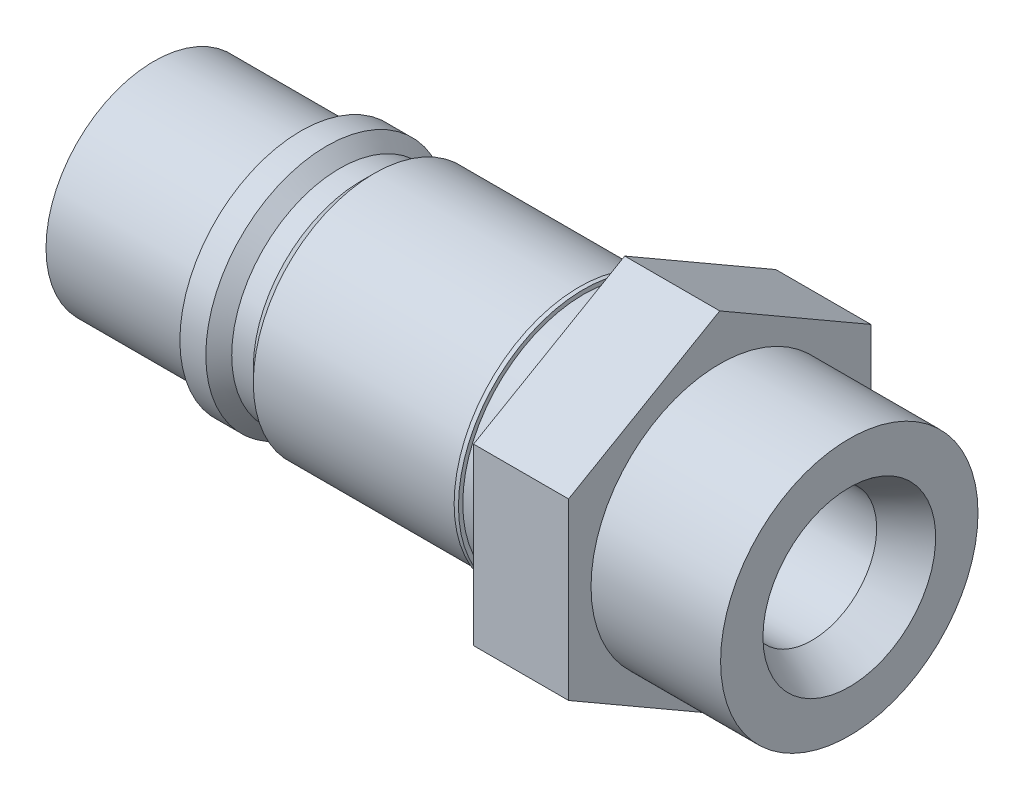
ISO-10303-21;
HEADER;
FILE_DESCRIPTION(('STEP AP214'),'2;1');
FILE_NAME('part.step','',(''),(''),'','','');
FILE_SCHEMA(('AUTOMOTIVE_DESIGN { 1 0 10303 214 1 1 1 1 }'));
ENDSEC;
DATA;
#1=APPLICATION_CONTEXT('core data for automotive mechanical design processes');
#2=APPLICATION_PROTOCOL_DEFINITION('international standard','automotive_design',2000,#1);
#3=PRODUCT_CONTEXT('',#1,'mechanical');
#4=PRODUCT('Part','Part','',(#3));
#5=PRODUCT_RELATED_PRODUCT_CATEGORY('part','',(#4));
#6=PRODUCT_DEFINITION_FORMATION('','',#4);
#7=PRODUCT_DEFINITION_CONTEXT('part definition',#1,'design');
#8=PRODUCT_DEFINITION('design','',#6,#7);
#9=PRODUCT_DEFINITION_SHAPE('','',#8);
#10=(LENGTH_UNIT() NAMED_UNIT(*) SI_UNIT(.MILLI.,.METRE.));
#11=(NAMED_UNIT(*) PLANE_ANGLE_UNIT() SI_UNIT($,.RADIAN.));
#12=(NAMED_UNIT(*) SI_UNIT($,.STERADIAN.) SOLID_ANGLE_UNIT());
#13=UNCERTAINTY_MEASURE_WITH_UNIT(LENGTH_MEASURE(1.E-05),#10,'distance_accuracy_value','');
#14=(GEOMETRIC_REPRESENTATION_CONTEXT(3) GLOBAL_UNCERTAINTY_ASSIGNED_CONTEXT((#13)) GLOBAL_UNIT_ASSIGNED_CONTEXT((#10,
#11,#12)) REPRESENTATION_CONTEXT('',''));
#15=CARTESIAN_POINT('',(0.,0.,0.));
#16=DIRECTION('',(0.,0.,1.));
#17=DIRECTION('',(1.,0.,0.));
#18=AXIS2_PLACEMENT_3D('',#15,#16,#17);
#19=CARTESIAN_POINT('',(0.,0.,0.));
#20=DIRECTION('',(1.,0.,0.));
#21=DIRECTION('',(0.,0.,-1.));
#22=AXIS2_PLACEMENT_3D('',#19,#20,#21);
#23=PLANE('',#22);
#24=CARTESIAN_POINT('',(0.,0.,0.));
#25=DIRECTION('',(-1.,0.,0.));
#26=DIRECTION('',(0.,0.,1.));
#27=AXIS2_PLACEMENT_3D('',#24,#25,#26);
#28=CIRCLE('',#27,15.);
#29=CARTESIAN_POINT('',(0.,0.,15.));
#30=VERTEX_POINT('',#29);
#31=EDGE_CURVE('E273',#30,#30,#28,.T.);
#32=ORIENTED_EDGE('',*,*,#31,.F.);
#33=EDGE_LOOP('',(#32));
#34=FACE_BOUND('',#33,.T.);
#35=CARTESIAN_POINT('',(0.,0.,0.));
#36=DIRECTION('',(-1.,0.,0.));
#37=DIRECTION('',(0.,0.,1.));
#38=AXIS2_PLACEMENT_3D('',#35,#36,#37);
#39=CIRCLE('',#38,25.);
#40=CARTESIAN_POINT('',(0.,0.,25.));
#41=VERTEX_POINT('',#40);
#42=EDGE_CURVE('E36',#41,#41,#39,.T.);
#43=ORIENTED_EDGE('',*,*,#42,.T.);
#44=EDGE_LOOP('',(#43));
#45=FACE_BOUND('',#44,.T.);
#46=ADVANCED_FACE('F33',(#34,#45),#23,.F.);
#47=CARTESIAN_POINT('',(0.,0.,0.));
#48=DIRECTION('',(-1.,0.,0.));
#49=DIRECTION('',(0.,0.,1.));
#50=AXIS2_PLACEMENT_3D('',#47,#48,#49);
#51=CYLINDRICAL_SURFACE('',#50,25.);
#52=ORIENTED_EDGE('',*,*,#42,.F.);
#53=EDGE_LOOP('',(#52));
#54=FACE_BOUND('',#53,.T.);
#55=CARTESIAN_POINT('',(34.,0.,0.));
#56=DIRECTION('',(-1.,0.,0.));
#57=DIRECTION('',(0.,0.,1.));
#58=AXIS2_PLACEMENT_3D('',#55,#56,#57);
#59=CIRCLE('',#58,25.);
#60=CARTESIAN_POINT('',(34.,0.,25.));
#61=VERTEX_POINT('',#60);
#62=EDGE_CURVE('E168',#61,#61,#59,.T.);
#63=ORIENTED_EDGE('',*,*,#62,.T.);
#64=EDGE_LOOP('',(#63));
#65=FACE_BOUND('',#64,.T.);
#66=ADVANCED_FACE('F176',(#54,#65),#51,.T.);
#67=CARTESIAN_POINT('',(34.,25.,0.));
#68=DIRECTION('',(1.,0.,0.));
#69=DIRECTION('',(0.,0.,-1.));
#70=AXIS2_PLACEMENT_3D('',#67,#68,#69);
#71=PLANE('',#70);
#72=ORIENTED_EDGE('',*,*,#62,.F.);
#73=EDGE_LOOP('',(#72));
#74=FACE_BOUND('',#73,.T.);
#75=CARTESIAN_POINT('',(34.,0.,0.));
#76=DIRECTION('',(-1.,0.,0.));
#77=DIRECTION('',(0.,0.,1.));
#78=AXIS2_PLACEMENT_3D('',#75,#76,#77);
#79=CIRCLE('',#78,28.);
#80=CARTESIAN_POINT('',(34.,0.,28.));
#81=VERTEX_POINT('',#80);
#82=EDGE_CURVE('E166',#81,#81,#79,.T.);
#83=ORIENTED_EDGE('',*,*,#82,.T.);
#84=EDGE_LOOP('',(#83));
#85=FACE_BOUND('',#84,.T.);
#86=ADVANCED_FACE('F178',(#74,#85),#71,.F.);
#87=CARTESIAN_POINT('',(0.,0.,0.));
#88=DIRECTION('',(-1.,0.,0.));
#89=DIRECTION('',(0.,0.,1.));
#90=AXIS2_PLACEMENT_3D('',#87,#88,#89);
#91=CYLINDRICAL_SURFACE('',#90,28.);
#92=ORIENTED_EDGE('',*,*,#82,.F.);
#93=EDGE_LOOP('',(#92));
#94=FACE_BOUND('',#93,.T.);
#95=CARTESIAN_POINT('',(40.,0.,0.));
#96=DIRECTION('',(-1.,0.,0.));
#97=DIRECTION('',(0.,0.,1.));
#98=AXIS2_PLACEMENT_3D('',#95,#96,#97);
#99=CIRCLE('',#98,28.);
#100=CARTESIAN_POINT('',(40.,0.,28.));
#101=VERTEX_POINT('',#100);
#102=EDGE_CURVE('E163',#101,#101,#99,.T.);
#103=ORIENTED_EDGE('',*,*,#102,.T.);
#104=EDGE_LOOP('',(#103));
#105=FACE_BOUND('',#104,.T.);
#106=ADVANCED_FACE('F183',(#94,#105),#91,.T.);
#107=CARTESIAN_POINT('',(43.,0.,0.));
#108=DIRECTION('',(-1.,0.,0.));
#109=DIRECTION('',(0.,0.,1.));
#110=AXIS2_PLACEMENT_3D('',#107,#108,#109);
#111=CONICAL_SURFACE('',#110,25.,0.78539816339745);
#112=ORIENTED_EDGE('',*,*,#102,.F.);
#113=EDGE_LOOP('',(#112));
#114=FACE_BOUND('',#113,.T.);
#115=CARTESIAN_POINT('',(43.,0.,0.));
#116=DIRECTION('',(-1.,0.,0.));
#117=DIRECTION('',(0.,0.,1.));
#118=AXIS2_PLACEMENT_3D('',#115,#116,#117);
#119=CIRCLE('',#118,25.);
#120=CARTESIAN_POINT('',(43.,0.,25.));
#121=VERTEX_POINT('',#120);
#122=EDGE_CURVE('E160',#121,#121,#119,.T.);
#123=ORIENTED_EDGE('',*,*,#122,.T.);
#124=EDGE_LOOP('',(#123));
#125=FACE_BOUND('',#124,.T.);
#126=ADVANCED_FACE('F190',(#114,#125),#111,.T.);
#127=CARTESIAN_POINT('',(0.,0.,0.));
#128=DIRECTION('',(-1.,0.,0.));
#129=DIRECTION('',(0.,0.,1.));
#130=AXIS2_PLACEMENT_3D('',#127,#128,#129);
#131=CYLINDRICAL_SURFACE('',#130,25.);
#132=ORIENTED_EDGE('',*,*,#122,.F.);
#133=EDGE_LOOP('',(#132));
#134=FACE_BOUND('',#133,.T.);
#135=CARTESIAN_POINT('',(48.,0.,0.));
#136=DIRECTION('',(-1.,0.,0.));
#137=DIRECTION('',(0.,0.,1.));
#138=AXIS2_PLACEMENT_3D('',#135,#136,#137);
#139=CIRCLE('',#138,25.);
#140=CARTESIAN_POINT('',(48.,0.,25.));
#141=VERTEX_POINT('',#140);
#142=EDGE_CURVE('E157',#141,#141,#139,.T.);
#143=ORIENTED_EDGE('',*,*,#142,.T.);
#144=EDGE_LOOP('',(#143));
#145=FACE_BOUND('',#144,.T.);
#146=ADVANCED_FACE('F194',(#134,#145),#131,.T.);
#147=CARTESIAN_POINT('',(51.,0.,0.));
#148=DIRECTION('',(1.,0.,0.));
#149=DIRECTION('',(0.,0.,-1.));
#150=AXIS2_PLACEMENT_3D('',#147,#148,#149);
#151=CONICAL_SURFACE('',#150,28.,0.785398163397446);
#152=ORIENTED_EDGE('',*,*,#142,.F.);
#153=EDGE_LOOP('',(#152));
#154=FACE_BOUND('',#153,.T.);
#155=CARTESIAN_POINT('',(51.,0.,0.));
#156=DIRECTION('',(-1.,0.,0.));
#157=DIRECTION('',(0.,0.,1.));
#158=AXIS2_PLACEMENT_3D('',#155,#156,#157);
#159=CIRCLE('',#158,28.);
#160=CARTESIAN_POINT('',(51.,0.,28.));
#161=VERTEX_POINT('',#160);
#162=EDGE_CURVE('E154',#161,#161,#159,.T.);
#163=ORIENTED_EDGE('',*,*,#162,.T.);
#164=EDGE_LOOP('',(#163));
#165=FACE_BOUND('',#164,.T.);
#166=ADVANCED_FACE('F198',(#154,#165),#151,.T.);
#167=CARTESIAN_POINT('',(0.,0.,0.));
#168=DIRECTION('',(-1.,0.,0.));
#169=DIRECTION('',(0.,0.,1.));
#170=AXIS2_PLACEMENT_3D('',#167,#168,#169);
#171=CYLINDRICAL_SURFACE('',#170,28.);
#172=ORIENTED_EDGE('',*,*,#162,.F.);
#173=EDGE_LOOP('',(#172));
#174=FACE_BOUND('',#173,.T.);
#175=CARTESIAN_POINT('',(98.5,0.,0.));
#176=DIRECTION('',(-1.,0.,0.));
#177=DIRECTION('',(0.,0.,1.));
#178=AXIS2_PLACEMENT_3D('',#175,#176,#177);
#179=CIRCLE('',#178,28.);
#180=CARTESIAN_POINT('',(98.5,0.,28.));
#181=VERTEX_POINT('',#180);
#182=EDGE_CURVE('E151',#181,#181,#179,.T.);
#183=ORIENTED_EDGE('',*,*,#182,.T.);
#184=EDGE_LOOP('',(#183));
#185=FACE_BOUND('',#184,.T.);
#186=ADVANCED_FACE('F202',(#174,#185),#171,.T.);
#187=CARTESIAN_POINT('',(98.5,28.,0.));
#188=DIRECTION('',(1.,0.,0.));
#189=DIRECTION('',(0.,0.,-1.));
#190=AXIS2_PLACEMENT_3D('',#187,#188,#189);
#191=PLANE('',#190);
#192=ORIENTED_EDGE('',*,*,#182,.F.);
#193=EDGE_LOOP('',(#192));
#194=FACE_BOUND('',#193,.T.);
#195=CARTESIAN_POINT('',(98.5,0.,0.));
#196=DIRECTION('',(-1.,0.,0.));
#197=DIRECTION('',(0.,0.,1.));
#198=AXIS2_PLACEMENT_3D('',#195,#196,#197);
#199=CIRCLE('',#198,29.);
#200=CARTESIAN_POINT('',(98.5,0.,29.));
#201=VERTEX_POINT('',#200);
#202=EDGE_CURVE('E148',#201,#201,#199,.T.);
#203=ORIENTED_EDGE('',*,*,#202,.T.);
#204=EDGE_LOOP('',(#203));
#205=FACE_BOUND('',#204,.T.);
#206=ADVANCED_FACE('F206',(#194,#205),#191,.F.);
#207=CARTESIAN_POINT('',(0.,0.,0.));
#208=DIRECTION('',(-1.,0.,0.));
#209=DIRECTION('',(0.,0.,1.));
#210=AXIS2_PLACEMENT_3D('',#207,#208,#209);
#211=CYLINDRICAL_SURFACE('',#210,29.);
#212=ORIENTED_EDGE('',*,*,#202,.F.);
#213=EDGE_LOOP('',(#212));
#214=FACE_BOUND('',#213,.T.);
#215=CARTESIAN_POINT('',(99.5,0.,0.));
#216=DIRECTION('',(-1.,0.,0.));
#217=DIRECTION('',(0.,0.,1.));
#218=AXIS2_PLACEMENT_3D('',#215,#216,#217);
#219=CIRCLE('',#218,29.);
#220=CARTESIAN_POINT('',(99.5,0.,29.));
#221=VERTEX_POINT('',#220);
#222=EDGE_CURVE('E145',#221,#221,#219,.T.);
#223=ORIENTED_EDGE('',*,*,#222,.T.);
#224=EDGE_LOOP('',(#223));
#225=FACE_BOUND('',#224,.T.);
#226=ADVANCED_FACE('F210',(#214,#225),#211,.T.);
#227=CARTESIAN_POINT('',(99.5,29.,0.));
#228=DIRECTION('',(-1.,0.,0.));
#229=DIRECTION('',(0.,0.,1.));
#230=AXIS2_PLACEMENT_3D('',#227,#228,#229);
#231=PLANE('',#230);
#232=ORIENTED_EDGE('',*,*,#222,.F.);
#233=EDGE_LOOP('',(#232));
#234=FACE_BOUND('',#233,.T.);
#235=CARTESIAN_POINT('',(99.5,0.,0.));
#236=DIRECTION('',(-1.,0.,0.));
#237=DIRECTION('',(0.,0.,1.));
#238=AXIS2_PLACEMENT_3D('',#235,#236,#237);
#239=CIRCLE('',#238,28.);
#240=CARTESIAN_POINT('',(99.5,0.,28.));
#241=VERTEX_POINT('',#240);
#242=EDGE_CURVE('E142',#241,#241,#239,.T.);
#243=ORIENTED_EDGE('',*,*,#242,.T.);
#244=EDGE_LOOP('',(#243));
#245=FACE_BOUND('',#244,.T.);
#246=ADVANCED_FACE('F214',(#234,#245),#231,.F.);
#247=CARTESIAN_POINT('',(0.,0.,0.));
#248=DIRECTION('',(-1.,0.,0.));
#249=DIRECTION('',(0.,0.,1.));
#250=AXIS2_PLACEMENT_3D('',#247,#248,#249);
#251=CYLINDRICAL_SURFACE('',#250,28.);
#252=ORIENTED_EDGE('',*,*,#242,.F.);
#253=EDGE_LOOP('',(#252));
#254=FACE_BOUND('',#253,.T.);
#255=CARTESIAN_POINT('',(109.,0.,0.));
#256=DIRECTION('',(-1.,0.,0.));
#257=DIRECTION('',(0.,0.,1.));
#258=AXIS2_PLACEMENT_3D('',#255,#256,#257);
#259=CIRCLE('',#258,28.);
#260=CARTESIAN_POINT('',(109.,0.,28.));
#261=VERTEX_POINT('',#260);
#262=EDGE_CURVE('E139',#261,#261,#259,.T.);
#263=ORIENTED_EDGE('',*,*,#262,.T.);
#264=EDGE_LOOP('',(#263));
#265=FACE_BOUND('',#264,.T.);
#266=ADVANCED_FACE('F218',(#254,#265),#251,.T.);
#267=CARTESIAN_POINT('',(131.,20.2072594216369,-35.));
#268=DIRECTION('',(0.,-0.866025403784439,0.5));
#269=DIRECTION('',(0.,-0.5,-0.866025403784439));
#270=AXIS2_PLACEMENT_3D('',#267,#268,#269);
#271=PLANE('',#270);
#272=DIRECTION('',(0.,0.5,0.866025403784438));
#273=VECTOR('',#272,1.);
#274=CARTESIAN_POINT('',(109.,20.2072594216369,-35.));
#275=LINE('',#274,#273);
#276=CARTESIAN_POINT('',(109.,20.2072594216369,-35.));
#277=VERTEX_POINT('',#276);
#278=CARTESIAN_POINT('',(109.,40.4145188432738,0.));
#279=VERTEX_POINT('',#278);
#280=EDGE_CURVE('E119',#277,#279,#275,.T.);
#281=ORIENTED_EDGE('',*,*,#280,.T.);
#282=DIRECTION('',(-1.,0.,0.));
#283=VECTOR('',#282,1.);
#284=CARTESIAN_POINT('',(131.,40.4145188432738,0.));
#285=LINE('',#284,#283);
#286=CARTESIAN_POINT('',(131.,40.4145188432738,0.));
#287=VERTEX_POINT('',#286);
#288=EDGE_CURVE('E137',#287,#279,#285,.T.);
#289=ORIENTED_EDGE('',*,*,#288,.F.);
#290=DIRECTION('',(0.,0.5,0.866025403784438));
#291=VECTOR('',#290,1.);
#292=CARTESIAN_POINT('',(131.,20.2072594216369,-35.));
#293=LINE('',#292,#291);
#294=CARTESIAN_POINT('',(131.,20.2072594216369,-35.));
#295=VERTEX_POINT('',#294);
#296=EDGE_CURVE('E130',#295,#287,#293,.T.);
#297=ORIENTED_EDGE('',*,*,#296,.F.);
#298=DIRECTION('',(-1.,0.,0.));
#299=VECTOR('',#298,1.);
#300=CARTESIAN_POINT('',(131.,20.2072594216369,-35.));
#301=LINE('',#300,#299);
#302=EDGE_CURVE('E115',#295,#277,#301,.T.);
#303=ORIENTED_EDGE('',*,*,#302,.T.);
#304=EDGE_LOOP('',(#281,#289,#297,#303));
#305=FACE_BOUND('',#304,.T.);
#306=ADVANCED_FACE('F222',(#305),#271,.F.);
#307=CARTESIAN_POINT('',(131.,40.4145188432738,0.));
#308=DIRECTION('',(0.,-0.866025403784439,-0.5));
#309=DIRECTION('',(0.,0.5,-0.866025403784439));
#310=AXIS2_PLACEMENT_3D('',#307,#308,#309);
#311=PLANE('',#310);
#312=DIRECTION('',(0.,-0.5,0.866025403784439));
#313=VECTOR('',#312,1.);
#314=CARTESIAN_POINT('',(109.,40.4145188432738,0.));
#315=LINE('',#314,#313);
#316=CARTESIAN_POINT('',(109.,20.2072594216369,35.));
#317=VERTEX_POINT('',#316);
#318=EDGE_CURVE('E122',#279,#317,#315,.T.);
#319=ORIENTED_EDGE('',*,*,#318,.T.);
#320=DIRECTION('',(-1.,0.,0.));
#321=VECTOR('',#320,1.);
#322=CARTESIAN_POINT('',(131.,20.2072594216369,35.));
#323=LINE('',#322,#321);
#324=CARTESIAN_POINT('',(131.,20.2072594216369,35.));
#325=VERTEX_POINT('',#324);
#326=EDGE_CURVE('E134',#325,#317,#323,.T.);
#327=ORIENTED_EDGE('',*,*,#326,.F.);
#328=DIRECTION('',(0.,-0.5,0.866025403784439));
#329=VECTOR('',#328,1.);
#330=CARTESIAN_POINT('',(131.,40.4145188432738,0.));
#331=LINE('',#330,#329);
#332=EDGE_CURVE('E88',#287,#325,#331,.T.);
#333=ORIENTED_EDGE('',*,*,#332,.F.);
#334=ORIENTED_EDGE('',*,*,#288,.T.);
#335=EDGE_LOOP('',(#319,#327,#333,#334));
#336=FACE_BOUND('',#335,.T.);
#337=ADVANCED_FACE('F226',(#336),#311,.F.);
#338=CARTESIAN_POINT('',(131.,20.2072594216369,35.));
#339=DIRECTION('',(0.,0.,-1.));
#340=DIRECTION('',(-1.,0.,0.));
#341=AXIS2_PLACEMENT_3D('',#338,#339,#340);
#342=PLANE('',#341);
#343=DIRECTION('',(0.,-1.,0.));
#344=VECTOR('',#343,1.);
#345=CARTESIAN_POINT('',(109.,20.2072594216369,35.));
#346=LINE('',#345,#344);
#347=CARTESIAN_POINT('',(109.,-20.2072594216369,35.));
#348=VERTEX_POINT('',#347);
#349=EDGE_CURVE('E125',#317,#348,#346,.T.);
#350=ORIENTED_EDGE('',*,*,#349,.T.);
#351=DIRECTION('',(-1.,0.,0.));
#352=VECTOR('',#351,1.);
#353=CARTESIAN_POINT('',(131.,-20.2072594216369,35.));
#354=LINE('',#353,#352);
#355=CARTESIAN_POINT('',(131.,-20.2072594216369,35.));
#356=VERTEX_POINT('',#355);
#357=EDGE_CURVE('E110',#356,#348,#354,.T.);
#358=ORIENTED_EDGE('',*,*,#357,.F.);
#359=DIRECTION('',(0.,-1.,0.));
#360=VECTOR('',#359,1.);
#361=CARTESIAN_POINT('',(131.,20.2072594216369,35.));
#362=LINE('',#361,#360);
#363=EDGE_CURVE('E101',#325,#356,#362,.T.);
#364=ORIENTED_EDGE('',*,*,#363,.F.);
#365=ORIENTED_EDGE('',*,*,#326,.T.);
#366=EDGE_LOOP('',(#350,#358,#364,#365));
#367=FACE_BOUND('',#366,.T.);
#368=ADVANCED_FACE('F230',(#367),#342,.F.);
#369=CARTESIAN_POINT('',(131.,-20.2072594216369,35.));
#370=DIRECTION('',(0.,0.866025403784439,-0.5));
#371=DIRECTION('',(0.,0.5,0.866025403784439));
#372=AXIS2_PLACEMENT_3D('',#369,#370,#371);
#373=PLANE('',#372);
#374=DIRECTION('',(0.,-0.5,-0.866025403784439));
#375=VECTOR('',#374,1.);
#376=CARTESIAN_POINT('',(109.,-20.2072594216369,35.));
#377=LINE('',#376,#375);
#378=CARTESIAN_POINT('',(109.,-40.4145188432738,0.));
#379=VERTEX_POINT('',#378);
#380=EDGE_CURVE('E109',#348,#379,#377,.T.);
#381=ORIENTED_EDGE('',*,*,#380,.T.);
#382=DIRECTION('',(-1.,0.,0.));
#383=VECTOR('',#382,1.);
#384=CARTESIAN_POINT('',(131.,-40.4145188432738,0.));
#385=LINE('',#384,#383);
#386=CARTESIAN_POINT('',(131.,-40.4145188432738,0.));
#387=VERTEX_POINT('',#386);
#388=EDGE_CURVE('E106',#387,#379,#385,.T.);
#389=ORIENTED_EDGE('',*,*,#388,.F.);
#390=DIRECTION('',(0.,-0.5,-0.866025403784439));
#391=VECTOR('',#390,1.);
#392=CARTESIAN_POINT('',(131.,-20.2072594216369,35.));
#393=LINE('',#392,#391);
#394=EDGE_CURVE('E95',#356,#387,#393,.T.);
#395=ORIENTED_EDGE('',*,*,#394,.F.);
#396=ORIENTED_EDGE('',*,*,#357,.T.);
#397=EDGE_LOOP('',(#381,#389,#395,#396));
#398=FACE_BOUND('',#397,.T.);
#399=ADVANCED_FACE('F107',(#398),#373,.F.);
#400=CARTESIAN_POINT('',(131.,-40.4145188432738,0.));
#401=DIRECTION('',(0.,0.866025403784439,0.5));
#402=DIRECTION('',(0.,-0.5,0.866025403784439));
#403=AXIS2_PLACEMENT_3D('',#400,#401,#402);
#404=PLANE('',#403);
#405=DIRECTION('',(0.,0.5,-0.866025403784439));
#406=VECTOR('',#405,1.);
#407=CARTESIAN_POINT('',(109.,-40.4145188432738,0.));
#408=LINE('',#407,#406);
#409=CARTESIAN_POINT('',(109.,-20.2072594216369,-35.));
#410=VERTEX_POINT('',#409);
#411=EDGE_CURVE('E73',#379,#410,#408,.T.);
#412=ORIENTED_EDGE('',*,*,#411,.T.);
#413=DIRECTION('',(-1.,0.,0.));
#414=VECTOR('',#413,1.);
#415=CARTESIAN_POINT('',(131.,-20.2072594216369,-35.));
#416=LINE('',#415,#414);
#417=CARTESIAN_POINT('',(131.,-20.2072594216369,-35.));
#418=VERTEX_POINT('',#417);
#419=EDGE_CURVE('E111',#418,#410,#416,.T.);
#420=ORIENTED_EDGE('',*,*,#419,.F.);
#421=DIRECTION('',(0.,0.5,-0.866025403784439));
#422=VECTOR('',#421,1.);
#423=CARTESIAN_POINT('',(131.,-40.4145188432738,0.));
#424=LINE('',#423,#422);
#425=EDGE_CURVE('E99',#387,#418,#424,.T.);
#426=ORIENTED_EDGE('',*,*,#425,.F.);
#427=ORIENTED_EDGE('',*,*,#388,.T.);
#428=EDGE_LOOP('',(#412,#420,#426,#427));
#429=FACE_BOUND('',#428,.T.);
#430=ADVANCED_FACE('F113',(#429),#404,.F.);
#431=CARTESIAN_POINT('',(131.,-20.2072594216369,-35.));
#432=DIRECTION('',(0.,0.,1.));
#433=DIRECTION('',(1.,0.,0.));
#434=AXIS2_PLACEMENT_3D('',#431,#432,#433);
#435=PLANE('',#434);
#436=DIRECTION('',(0.,1.,0.));
#437=VECTOR('',#436,1.);
#438=CARTESIAN_POINT('',(109.,-20.2072594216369,-35.));
#439=LINE('',#438,#437);
#440=EDGE_CURVE('E79',#410,#277,#439,.T.);
#441=ORIENTED_EDGE('',*,*,#440,.T.);
#442=ORIENTED_EDGE('',*,*,#302,.F.);
#443=DIRECTION('',(0.,1.,0.));
#444=VECTOR('',#443,1.);
#445=CARTESIAN_POINT('',(131.,-20.2072594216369,-35.));
#446=LINE('',#445,#444);
#447=EDGE_CURVE('E50',#418,#295,#446,.T.);
#448=ORIENTED_EDGE('',*,*,#447,.F.);
#449=ORIENTED_EDGE('',*,*,#419,.T.);
#450=EDGE_LOOP('',(#441,#442,#448,#449));
#451=FACE_BOUND('',#450,.T.);
#452=ADVANCED_FACE('F238',(#451),#435,.F.);
#453=CARTESIAN_POINT('',(131.,0.,0.));
#454=DIRECTION('',(1.,0.,0.));
#455=DIRECTION('',(0.,0.,-1.));
#456=AXIS2_PLACEMENT_3D('',#453,#454,#455);
#457=PLANE('',#456);
#458=CARTESIAN_POINT('',(131.,0.,0.));
#459=DIRECTION('',(1.,0.,0.));
#460=DIRECTION('',(0.,0.,-1.));
#461=AXIS2_PLACEMENT_3D('',#458,#459,#460);
#462=CIRCLE('',#461,29.8);
#463=CARTESIAN_POINT('',(131.,0.,-29.8));
#464=VERTEX_POINT('',#463);
#465=EDGE_CURVE('E11',#464,#464,#462,.T.);
#466=ORIENTED_EDGE('',*,*,#465,.F.);
#467=EDGE_LOOP('',(#466));
#468=FACE_BOUND('',#467,.T.);
#469=ORIENTED_EDGE('',*,*,#296,.T.);
#470=ORIENTED_EDGE('',*,*,#332,.T.);
#471=ORIENTED_EDGE('',*,*,#363,.T.);
#472=ORIENTED_EDGE('',*,*,#394,.T.);
#473=ORIENTED_EDGE('',*,*,#425,.T.);
#474=ORIENTED_EDGE('',*,*,#447,.T.);
#475=EDGE_LOOP('',(#469,#470,#471,#472,#473,#474));
#476=FACE_BOUND('',#475,.T.);
#477=ADVANCED_FACE('F97',(#468,#476),#457,.T.);
#478=CARTESIAN_POINT('',(109.,0.,0.));
#479=DIRECTION('',(1.,0.,0.));
#480=DIRECTION('',(0.,0.,-1.));
#481=AXIS2_PLACEMENT_3D('',#478,#479,#480);
#482=PLANE('',#481);
#483=ORIENTED_EDGE('',*,*,#262,.F.);
#484=EDGE_LOOP('',(#483));
#485=FACE_BOUND('',#484,.T.);
#486=ORIENTED_EDGE('',*,*,#280,.F.);
#487=ORIENTED_EDGE('',*,*,#440,.F.);
#488=ORIENTED_EDGE('',*,*,#411,.F.);
#489=ORIENTED_EDGE('',*,*,#380,.F.);
#490=ORIENTED_EDGE('',*,*,#349,.F.);
#491=ORIENTED_EDGE('',*,*,#318,.F.);
#492=EDGE_LOOP('',(#486,#487,#488,#489,#490,#491));
#493=FACE_BOUND('',#492,.T.);
#494=ADVANCED_FACE('F241',(#485,#493),#482,.F.);
#495=CARTESIAN_POINT('',(161.,0.,0.));
#496=DIRECTION('',(-1.,0.,0.));
#497=DIRECTION('',(0.,0.,1.));
#498=AXIS2_PLACEMENT_3D('',#495,#496,#497);
#499=CYLINDRICAL_SURFACE('',#498,29.8);
#500=CARTESIAN_POINT('',(161.,0.,0.));
#501=DIRECTION('',(1.,0.,0.));
#502=DIRECTION('',(0.,0.,-1.));
#503=AXIS2_PLACEMENT_3D('',#500,#501,#502);
#504=CIRCLE('',#503,29.8);
#505=CARTESIAN_POINT('',(161.,0.,-29.8));
#506=VERTEX_POINT('',#505);
#507=EDGE_CURVE('E123',#506,#506,#504,.T.);
#508=ORIENTED_EDGE('',*,*,#507,.F.);
#509=EDGE_LOOP('',(#508));
#510=FACE_BOUND('',#509,.T.);
#511=ORIENTED_EDGE('',*,*,#465,.T.);
#512=EDGE_LOOP('',(#511));
#513=FACE_BOUND('',#512,.T.);
#514=ADVANCED_FACE('F244',(#510,#513),#499,.T.);
#515=CARTESIAN_POINT('',(161.,0.,0.));
#516=DIRECTION('',(1.,0.,0.));
#517=DIRECTION('',(0.,0.,-1.));
#518=AXIS2_PLACEMENT_3D('',#515,#516,#517);
#519=PLANE('',#518);
#520=CARTESIAN_POINT('',(161.,0.,0.));
#521=DIRECTION('',(-1.,0.,0.));
#522=DIRECTION('',(0.,0.,1.));
#523=AXIS2_PLACEMENT_3D('',#520,#521,#522);
#524=CIRCLE('',#523,20.);
#525=CARTESIAN_POINT('',(161.,0.,20.));
#526=VERTEX_POINT('',#525);
#527=EDGE_CURVE('E271',#526,#526,#524,.T.);
#528=ORIENTED_EDGE('',*,*,#527,.T.);
#529=EDGE_LOOP('',(#528));
#530=FACE_BOUND('',#529,.T.);
#531=ORIENTED_EDGE('',*,*,#507,.T.);
#532=EDGE_LOOP('',(#531));
#533=FACE_BOUND('',#532,.T.);
#534=ADVANCED_FACE('F251',(#530,#533),#519,.T.);
#535=CARTESIAN_POINT('',(0.,0.,0.));
#536=DIRECTION('',(-1.,0.,0.));
#537=DIRECTION('',(0.,0.,1.));
#538=AXIS2_PLACEMENT_3D('',#535,#536,#537);
#539=CYLINDRICAL_SURFACE('',#538,15.);
#540=ORIENTED_EDGE('',*,*,#31,.T.);
#541=EDGE_LOOP('',(#540));
#542=FACE_BOUND('',#541,.T.);
#543=CARTESIAN_POINT('',(152.339745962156,0.,0.));
#544=DIRECTION('',(-1.,0.,0.));
#545=DIRECTION('',(0.,0.,1.));
#546=AXIS2_PLACEMENT_3D('',#543,#544,#545);
#547=CIRCLE('',#546,15.);
#548=CARTESIAN_POINT('',(152.339745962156,0.,15.));
#549=VERTEX_POINT('',#548);
#550=EDGE_CURVE('E268',#549,#549,#547,.T.);
#551=ORIENTED_EDGE('',*,*,#550,.F.);
#552=EDGE_LOOP('',(#551));
#553=FACE_BOUND('',#552,.T.);
#554=ADVANCED_FACE('F255',(#542,#553),#539,.F.);
#555=CARTESIAN_POINT('',(161.,0.,0.));
#556=DIRECTION('',(1.,0.,0.));
#557=DIRECTION('',(0.,0.,-1.));
#558=AXIS2_PLACEMENT_3D('',#555,#556,#557);
#559=CONICAL_SURFACE('',#558,20.,0.523598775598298);
#560=ORIENTED_EDGE('',*,*,#550,.T.);
#561=EDGE_LOOP('',(#560));
#562=FACE_BOUND('',#561,.T.);
#563=ORIENTED_EDGE('',*,*,#527,.F.);
#564=EDGE_LOOP('',(#563));
#565=FACE_BOUND('',#564,.T.);
#566=ADVANCED_FACE('F259',(#562,#565),#559,.F.);
#567=CLOSED_SHELL('',(#46,#66,#86,#106,#126,#146,#166,#186,#206,#226,#246,#266,#306,#337,#368,
#399,#430,#452,#477,#494,#514,#534,#554,#566));
#568=MANIFOLD_SOLID_BREP('B2',#567);
#569=ADVANCED_BREP_SHAPE_REPRESENTATION('',(#18,#568),#14);
#570=SHAPE_DEFINITION_REPRESENTATION(#9,#569);
ENDSEC;
END-ISO-10303-21;
